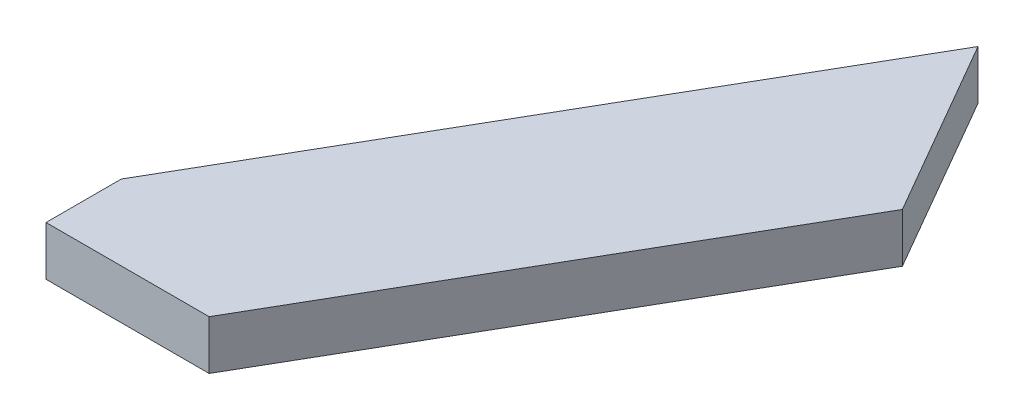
from build123d import *

# Parameters (mm, degrees)
BOSS_EXTRUDE1_DEPTH = 17.4625


with BuildPart() as part:
    # Sketch3 → Boss-Extrude1 (new, symmetric)
    with BuildSketch(Plane(origin=(0, 0, 0), x_dir=(-1, 0, 0), z_dir=(0, 1, 0))):
        Polygon((39.293280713, 195.057958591), (155.112278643, 195.057958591), (155.112278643, 141.662347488), (-67.508638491, -243.928391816), (-140.832123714, -116.92839361), align=None)
    extrude(amount=BOSS_EXTRUDE1_DEPTH, both=True)


solid = part.part
